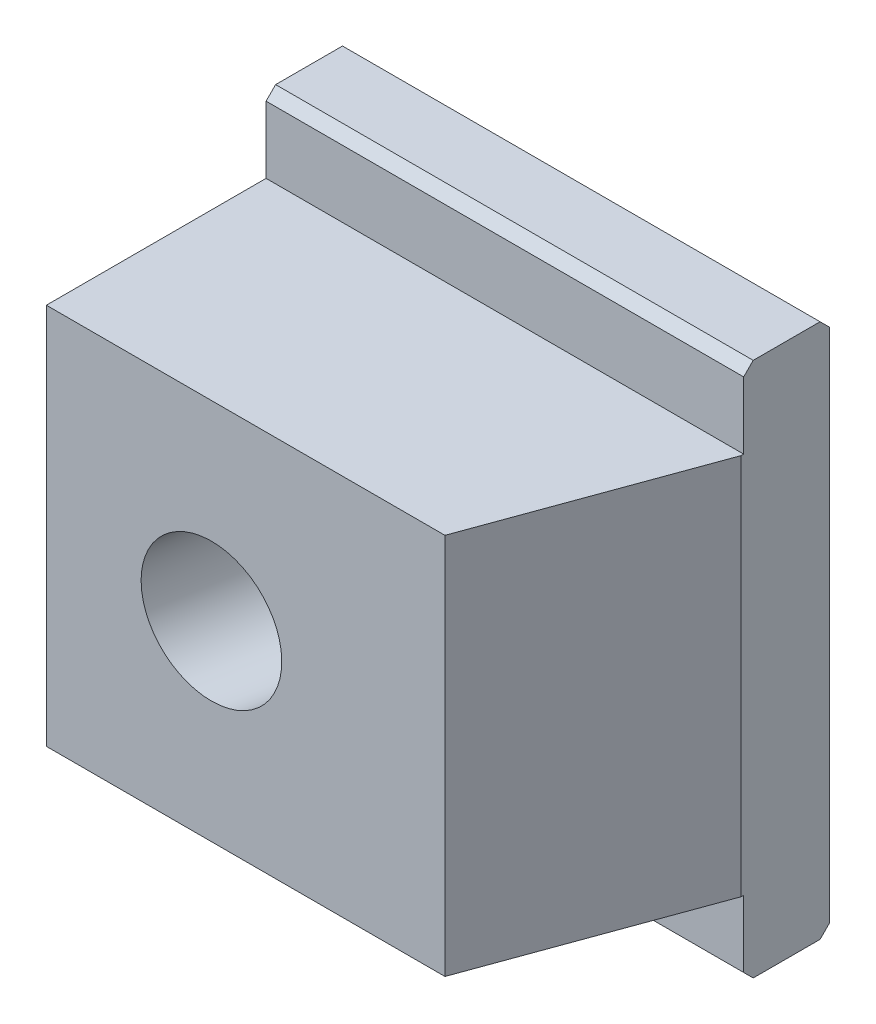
ISO-10303-21;
HEADER;
FILE_DESCRIPTION(('STEP AP214'),'2;1');
FILE_NAME('part.step','',(''),(''),'','','');
FILE_SCHEMA(('AUTOMOTIVE_DESIGN { 1 0 10303 214 1 1 1 1 }'));
ENDSEC;
DATA;
#1=APPLICATION_CONTEXT('core data for automotive mechanical design processes');
#2=APPLICATION_PROTOCOL_DEFINITION('international standard','automotive_design',2000,#1);
#3=PRODUCT_CONTEXT('',#1,'mechanical');
#4=PRODUCT('Part','Part','',(#3));
#5=PRODUCT_RELATED_PRODUCT_CATEGORY('part','',(#4));
#6=PRODUCT_DEFINITION_FORMATION('','',#4);
#7=PRODUCT_DEFINITION_CONTEXT('part definition',#1,'design');
#8=PRODUCT_DEFINITION('design','',#6,#7);
#9=PRODUCT_DEFINITION_SHAPE('','',#8);
#10=(LENGTH_UNIT() NAMED_UNIT(*) SI_UNIT(.MILLI.,.METRE.));
#11=(NAMED_UNIT(*) PLANE_ANGLE_UNIT() SI_UNIT($,.RADIAN.));
#12=(NAMED_UNIT(*) SI_UNIT($,.STERADIAN.) SOLID_ANGLE_UNIT());
#13=UNCERTAINTY_MEASURE_WITH_UNIT(LENGTH_MEASURE(1.E-05),#10,'distance_accuracy_value','');
#14=(GEOMETRIC_REPRESENTATION_CONTEXT(3) GLOBAL_UNCERTAINTY_ASSIGNED_CONTEXT((#13)) GLOBAL_UNIT_ASSIGNED_CONTEXT((#10,
#11,#12)) REPRESENTATION_CONTEXT('',''));
#15=CARTESIAN_POINT('',(0.,0.,0.));
#16=DIRECTION('',(0.,0.,1.));
#17=DIRECTION('',(1.,0.,0.));
#18=AXIS2_PLACEMENT_3D('',#15,#16,#17);
#19=CARTESIAN_POINT('',(121.,-21.85,-40.));
#20=DIRECTION('',(-1.,0.,0.));
#21=DIRECTION('',(0.,0.,-1.));
#22=AXIS2_PLACEMENT_3D('',#19,#20,#21);
#23=PLANE('',#22);
#24=CARTESIAN_POINT('',(121.,-27.85,-10.));
#25=DIRECTION('',(-1.,0.,0.));
#26=DIRECTION('',(0.,0.,1.));
#27=AXIS2_PLACEMENT_3D('',#24,#25,#26);
#28=CIRCLE('',#27,2.1);
#29=CARTESIAN_POINT('',(121.,-27.85,-7.9));
#30=VERTEX_POINT('',#29);
#31=EDGE_CURVE('E338',#30,#30,#28,.T.);
#32=ORIENTED_EDGE('',*,*,#31,.F.);
#33=EDGE_LOOP('',(#32));
#34=FACE_BOUND('',#33,.T.);
#35=CARTESIAN_POINT('',(121.,-55.85,-23.));
#36=DIRECTION('',(-1.,0.,0.));
#37=DIRECTION('',(0.,0.,1.));
#38=AXIS2_PLACEMENT_3D('',#35,#36,#37);
#39=CIRCLE('',#38,2.1);
#40=CARTESIAN_POINT('',(121.,-55.85,-20.9));
#41=VERTEX_POINT('',#40);
#42=EDGE_CURVE('E340',#41,#41,#39,.T.);
#43=ORIENTED_EDGE('',*,*,#42,.F.);
#44=EDGE_LOOP('',(#43));
#45=FACE_BOUND('',#44,.T.);
#46=DIRECTION('',(0.,0.,-1.));
#47=VECTOR('',#46,1.);
#48=CARTESIAN_POINT('',(121.,-13.8500000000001,-25.));
#49=LINE('',#48,#47);
#50=CARTESIAN_POINT('',(121.,-13.8500000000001,-26.));
#51=VERTEX_POINT('',#50);
#52=CARTESIAN_POINT('',(121.,-13.8500000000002,-33.));
#53=VERTEX_POINT('',#52);
#54=EDGE_CURVE('E138',#51,#53,#49,.T.);
#55=ORIENTED_EDGE('',*,*,#54,.T.);
#56=DIRECTION('',(0.,0.707106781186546,0.707106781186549));
#57=VECTOR('',#56,1.);
#58=CARTESIAN_POINT('',(121.,-21.35,-40.5));
#59=LINE('',#58,#57);
#60=CARTESIAN_POINT('',(121.,-14.8500000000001,-34.));
#61=VERTEX_POINT('',#60);
#62=EDGE_CURVE('E37',#53,#61,#59,.F.);
#63=ORIENTED_EDGE('',*,*,#62,.T.);
#64=DIRECTION('',(0.,-1.,0.));
#65=VECTOR('',#64,1.);
#66=CARTESIAN_POINT('',(121.,-21.85,-34.));
#67=LINE('',#66,#65);
#68=CARTESIAN_POINT('',(121.,-68.85,-34.));
#69=VERTEX_POINT('',#68);
#70=EDGE_CURVE('E179',#61,#69,#67,.T.);
#71=ORIENTED_EDGE('',*,*,#70,.T.);
#72=DIRECTION('',(0.,0.707106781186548,-0.707106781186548));
#73=VECTOR('',#72,1.);
#74=CARTESIAN_POINT('',(121.,-42.35,-60.5));
#75=LINE('',#74,#73);
#76=CARTESIAN_POINT('',(121.,-69.85,-33.));
#77=VERTEX_POINT('',#76);
#78=EDGE_CURVE('E142',#69,#77,#75,.F.);
#79=ORIENTED_EDGE('',*,*,#78,.T.);
#80=DIRECTION('',(0.,0.,1.));
#81=VECTOR('',#80,1.);
#82=CARTESIAN_POINT('',(121.,-69.85,-40.));
#83=LINE('',#82,#81);
#84=CARTESIAN_POINT('',(121.,-69.85,-26.));
#85=VERTEX_POINT('',#84);
#86=EDGE_CURVE('E174',#77,#85,#83,.T.);
#87=ORIENTED_EDGE('',*,*,#86,.T.);
#88=DIRECTION('',(0.,-0.707106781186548,-0.707106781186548));
#89=VECTOR('',#88,1.);
#90=CARTESIAN_POINT('',(121.,-52.85,-9.));
#91=LINE('',#90,#89);
#92=CARTESIAN_POINT('',(121.,-68.85,-25.));
#93=VERTEX_POINT('',#92);
#94=EDGE_CURVE('E158',#85,#93,#91,.F.);
#95=ORIENTED_EDGE('',*,*,#94,.T.);
#96=DIRECTION('',(0.,1.,0.));
#97=VECTOR('',#96,1.);
#98=CARTESIAN_POINT('',(121.,-69.85,-25.));
#99=LINE('',#98,#97);
#100=CARTESIAN_POINT('',(121.,-61.85,-25.));
#101=VERTEX_POINT('',#100);
#102=EDGE_CURVE('E171',#93,#101,#99,.T.);
#103=ORIENTED_EDGE('',*,*,#102,.T.);
#104=DIRECTION('',(0.,0.,-1.));
#105=VECTOR('',#104,1.);
#106=CARTESIAN_POINT('',(121.,-61.85,-2.));
#107=LINE('',#106,#105);
#108=CARTESIAN_POINT('',(121.,-61.85,-2.));
#109=VERTEX_POINT('',#108);
#110=EDGE_CURVE('E167',#109,#101,#107,.T.);
#111=ORIENTED_EDGE('',*,*,#110,.F.);
#112=DIRECTION('',(0.,-1.,0.));
#113=VECTOR('',#112,1.);
#114=CARTESIAN_POINT('',(121.,-21.85,-2.));
#115=LINE('',#114,#113);
#116=CARTESIAN_POINT('',(121.,-21.85,-2.));
#117=VERTEX_POINT('',#116);
#118=EDGE_CURVE('E163',#117,#109,#115,.T.);
#119=ORIENTED_EDGE('',*,*,#118,.F.);
#120=DIRECTION('',(0.,0.,1.));
#121=VECTOR('',#120,1.);
#122=CARTESIAN_POINT('',(121.,-21.85,-40.));
#123=LINE('',#122,#121);
#124=CARTESIAN_POINT('',(121.,-21.85,-25.));
#125=VERTEX_POINT('',#124);
#126=EDGE_CURVE('E160',#125,#117,#123,.T.);
#127=ORIENTED_EDGE('',*,*,#126,.F.);
#128=DIRECTION('',(0.,1.,0.));
#129=VECTOR('',#128,1.);
#130=CARTESIAN_POINT('',(121.,-21.85,-25.));
#131=LINE('',#130,#129);
#132=CARTESIAN_POINT('',(121.,-14.8500000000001,-25.));
#133=VERTEX_POINT('',#132);
#134=EDGE_CURVE('E148',#125,#133,#131,.T.);
#135=ORIENTED_EDGE('',*,*,#134,.T.);
#136=DIRECTION('',(0.,-0.707106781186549,0.707106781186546));
#137=VECTOR('',#136,1.);
#138=CARTESIAN_POINT('',(121.,-10.8500000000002,-29.));
#139=LINE('',#138,#137);
#140=EDGE_CURVE('E132',#133,#51,#139,.F.);
#141=ORIENTED_EDGE('',*,*,#140,.T.);
#142=EDGE_LOOP('',(#55,#63,#71,#79,#87,#95,#103,#111,#119,#127,#135,#141));
#143=FACE_BOUND('',#142,.T.);
#144=ADVANCED_FACE('F34',(#34,#45,#143),#23,.T.);
#145=CARTESIAN_POINT('',(171.,-21.85,-40.));
#146=DIRECTION('',(-1.,0.,0.));
#147=DIRECTION('',(0.,0.,-1.));
#148=AXIS2_PLACEMENT_3D('',#145,#146,#147);
#149=PLANE('',#148);
#150=DIRECTION('',(0.,-1.,0.));
#151=VECTOR('',#150,1.);
#152=CARTESIAN_POINT('',(171.,-21.85,-34.));
#153=LINE('',#152,#151);
#154=CARTESIAN_POINT('',(171.,-14.8500000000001,-34.));
#155=VERTEX_POINT('',#154);
#156=CARTESIAN_POINT('',(171.,-68.85,-34.));
#157=VERTEX_POINT('',#156);
#158=EDGE_CURVE('E180',#155,#157,#153,.T.);
#159=ORIENTED_EDGE('',*,*,#158,.F.);
#160=DIRECTION('',(0.,-0.707106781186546,-0.707106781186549));
#161=VECTOR('',#160,1.);
#162=CARTESIAN_POINT('',(171.,-13.8500000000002,-33.));
#163=LINE('',#162,#161);
#164=CARTESIAN_POINT('',(171.,-13.8500000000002,-33.));
#165=VERTEX_POINT('',#164);
#166=EDGE_CURVE('E156',#155,#165,#163,.F.);
#167=ORIENTED_EDGE('',*,*,#166,.T.);
#168=DIRECTION('',(0.,0.,-1.));
#169=VECTOR('',#168,1.);
#170=CARTESIAN_POINT('',(171.,-13.8500000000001,-25.));
#171=LINE('',#170,#169);
#172=CARTESIAN_POINT('',(171.,-13.8500000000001,-26.));
#173=VERTEX_POINT('',#172);
#174=EDGE_CURVE('E141',#173,#165,#171,.T.);
#175=ORIENTED_EDGE('',*,*,#174,.F.);
#176=DIRECTION('',(0.,0.707106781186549,-0.707106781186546));
#177=VECTOR('',#176,1.);
#178=CARTESIAN_POINT('',(171.,-13.8500000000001,-26.));
#179=LINE('',#178,#177);
#180=CARTESIAN_POINT('',(171.,-14.8500000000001,-25.));
#181=VERTEX_POINT('',#180);
#182=EDGE_CURVE('E241',#173,#181,#179,.F.);
#183=ORIENTED_EDGE('',*,*,#182,.T.);
#184=DIRECTION('',(0.,1.,0.));
#185=VECTOR('',#184,1.);
#186=CARTESIAN_POINT('',(171.,-21.85,-25.));
#187=LINE('',#186,#185);
#188=CARTESIAN_POINT('',(171.,-21.85,-25.));
#189=VERTEX_POINT('',#188);
#190=EDGE_CURVE('E178',#189,#181,#187,.T.);
#191=ORIENTED_EDGE('',*,*,#190,.F.);
#192=DIRECTION('',(0.,0.,1.));
#193=VECTOR('',#192,1.);
#194=CARTESIAN_POINT('',(171.,-21.85,-40.));
#195=LINE('',#194,#193);
#196=CARTESIAN_POINT('',(171.,-21.85,-24.7272967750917));
#197=VERTEX_POINT('',#196);
#198=EDGE_CURVE('E170',#189,#197,#195,.T.);
#199=ORIENTED_EDGE('',*,*,#198,.T.);
#200=DIRECTION('',(0.,-1.,0.));
#201=VECTOR('',#200,1.);
#202=CARTESIAN_POINT('',(171.,-9.04997250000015,-24.7272967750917));
#203=LINE('',#202,#201);
#204=CARTESIAN_POINT('',(171.,-61.85,-24.7272967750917));
#205=VERTEX_POINT('',#204);
#206=EDGE_CURVE('E212',#197,#205,#203,.T.);
#207=ORIENTED_EDGE('',*,*,#206,.T.);
#208=DIRECTION('',(0.,0.,-1.));
#209=VECTOR('',#208,1.);
#210=CARTESIAN_POINT('',(171.,-61.85,-2.));
#211=LINE('',#210,#209);
#212=CARTESIAN_POINT('',(171.,-61.85,-25.));
#213=VERTEX_POINT('',#212);
#214=EDGE_CURVE('E225',#205,#213,#211,.T.);
#215=ORIENTED_EDGE('',*,*,#214,.T.);
#216=DIRECTION('',(0.,1.,0.));
#217=VECTOR('',#216,1.);
#218=CARTESIAN_POINT('',(171.,-69.85,-25.));
#219=LINE('',#218,#217);
#220=CARTESIAN_POINT('',(171.,-68.85,-25.));
#221=VERTEX_POINT('',#220);
#222=EDGE_CURVE('E222',#221,#213,#219,.T.);
#223=ORIENTED_EDGE('',*,*,#222,.F.);
#224=DIRECTION('',(0.,0.707106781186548,0.707106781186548));
#225=VECTOR('',#224,1.);
#226=CARTESIAN_POINT('',(171.,-68.85,-25.));
#227=LINE('',#226,#225);
#228=CARTESIAN_POINT('',(171.,-69.85,-26.));
#229=VERTEX_POINT('',#228);
#230=EDGE_CURVE('E52',#221,#229,#227,.F.);
#231=ORIENTED_EDGE('',*,*,#230,.T.);
#232=DIRECTION('',(0.,0.,1.));
#233=VECTOR('',#232,1.);
#234=CARTESIAN_POINT('',(171.,-69.85,-40.));
#235=LINE('',#234,#233);
#236=CARTESIAN_POINT('',(171.,-69.85,-33.));
#237=VERTEX_POINT('',#236);
#238=EDGE_CURVE('E164',#237,#229,#235,.T.);
#239=ORIENTED_EDGE('',*,*,#238,.F.);
#240=DIRECTION('',(0.,-0.707106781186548,0.707106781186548));
#241=VECTOR('',#240,1.);
#242=CARTESIAN_POINT('',(171.,-69.85,-33.));
#243=LINE('',#242,#241);
#244=EDGE_CURVE('E201',#237,#157,#243,.F.);
#245=ORIENTED_EDGE('',*,*,#244,.T.);
#246=EDGE_LOOP('',(#159,#167,#175,#183,#191,#199,#207,#215,#223,#231,#239,#245));
#247=FACE_BOUND('',#246,.T.);
#248=ADVANCED_FACE('F252',(#247),#149,.F.);
#249=CARTESIAN_POINT('',(-325.,-69.85,-40.));
#250=DIRECTION('',(0.,-1.,0.));
#251=DIRECTION('',(0.,0.,-1.));
#252=AXIS2_PLACEMENT_3D('',#249,#250,#251);
#253=PLANE('',#252);
#254=ORIENTED_EDGE('',*,*,#238,.T.);
#255=DIRECTION('',(-1.,0.,0.));
#256=VECTOR('',#255,1.);
#257=CARTESIAN_POINT('',(-325.,-69.85,-26.));
#258=LINE('',#257,#256);
#259=EDGE_CURVE('E11',#229,#85,#258,.T.);
#260=ORIENTED_EDGE('',*,*,#259,.T.);
#261=ORIENTED_EDGE('',*,*,#86,.F.);
#262=DIRECTION('',(1.,0.,0.));
#263=VECTOR('',#262,1.);
#264=CARTESIAN_POINT('',(-325.,-69.85,-33.));
#265=LINE('',#264,#263);
#266=EDGE_CURVE('E43',#77,#237,#265,.T.);
#267=ORIENTED_EDGE('',*,*,#266,.T.);
#268=EDGE_LOOP('',(#254,#260,#261,#267));
#269=FACE_BOUND('',#268,.T.);
#270=ADVANCED_FACE('F254',(#269),#253,.T.);
#271=CARTESIAN_POINT('',(-325.,-13.8500000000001,-25.));
#272=DIRECTION('',(0.,1.,0.));
#273=DIRECTION('',(0.,0.,1.));
#274=AXIS2_PLACEMENT_3D('',#271,#272,#273);
#275=PLANE('',#274);
#276=ORIENTED_EDGE('',*,*,#174,.T.);
#277=DIRECTION('',(-1.,0.,0.));
#278=VECTOR('',#277,1.);
#279=CARTESIAN_POINT('',(-325.,-13.8500000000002,-33.));
#280=LINE('',#279,#278);
#281=EDGE_CURVE('E129',#165,#53,#280,.T.);
#282=ORIENTED_EDGE('',*,*,#281,.T.);
#283=ORIENTED_EDGE('',*,*,#54,.F.);
#284=DIRECTION('',(1.,0.,0.));
#285=VECTOR('',#284,1.);
#286=CARTESIAN_POINT('',(-325.,-13.8500000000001,-26.));
#287=LINE('',#286,#285);
#288=EDGE_CURVE('E143',#51,#173,#287,.T.);
#289=ORIENTED_EDGE('',*,*,#288,.T.);
#290=EDGE_LOOP('',(#276,#282,#283,#289));
#291=FACE_BOUND('',#290,.T.);
#292=ADVANCED_FACE('F136',(#291),#275,.T.);
#293=CARTESIAN_POINT('',(146.716830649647,-41.85,-49.8434097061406));
#294=DIRECTION('',(-0.17364817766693,0.,0.984807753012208));
#295=DIRECTION('',(0.984807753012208,0.,0.17364817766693));
#296=AXIS2_PLACEMENT_3D('',#293,#294,#295);
#297=CYLINDRICAL_SURFACE('',#296,7.25);
#298=CARTESIAN_POINT('',(138.280746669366,-41.85,-2.));
#299=DIRECTION('',(0.,0.,1.));
#300=DIRECTION('',(-1.,0.,0.));
#301=AXIS2_PLACEMENT_3D('',#298,#299,#300);
#302=ELLIPSE('',#301,7.36184293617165,7.25);
#303=CARTESIAN_POINT('',(130.918903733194,-41.85,-2.));
#304=VERTEX_POINT('',#303);
#305=EDGE_CURVE('E184',#304,#304,#302,.T.);
#306=ORIENTED_EDGE('',*,*,#305,.T.);
#307=EDGE_LOOP('',(#306));
#308=FACE_BOUND('',#307,.T.);
#309=CARTESIAN_POINT('',(143.923210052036,-41.85,-34.));
#310=DIRECTION('',(0.,0.,-1.));
#311=DIRECTION('',(-1.,0.,0.));
#312=AXIS2_PLACEMENT_3D('',#309,#310,#311);
#313=ELLIPSE('',#312,7.36184293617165,7.25);
#314=CARTESIAN_POINT('',(136.561367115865,-41.85,-34.));
#315=VERTEX_POINT('',#314);
#316=EDGE_CURVE('E181',#315,#315,#313,.F.);
#317=ORIENTED_EDGE('',*,*,#316,.F.);
#318=EDGE_LOOP('',(#317));
#319=FACE_BOUND('',#318,.T.);
#320=ADVANCED_FACE('F282',(#308,#319),#297,.F.);
#321=CARTESIAN_POINT('',(170.,-21.85,-40.));
#322=DIRECTION('',(0.,1.,0.));
#323=DIRECTION('',(0.,0.,1.));
#324=AXIS2_PLACEMENT_3D('',#321,#322,#323);
#325=PLANE('',#324);
#326=ORIENTED_EDGE('',*,*,#198,.F.);
#327=DIRECTION('',(1.,0.,0.));
#328=VECTOR('',#327,1.);
#329=CARTESIAN_POINT('',(-325.,-21.85,-25.));
#330=LINE('',#329,#328);
#331=EDGE_CURVE('E147',#125,#189,#330,.T.);
#332=ORIENTED_EDGE('',*,*,#331,.F.);
#333=ORIENTED_EDGE('',*,*,#126,.T.);
#334=DIRECTION('',(-1.,0.,0.));
#335=VECTOR('',#334,1.);
#336=CARTESIAN_POINT('',(170.,-21.85,-2.));
#337=LINE('',#336,#335);
#338=CARTESIAN_POINT('',(162.727940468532,-21.85,-2.));
#339=VERTEX_POINT('',#338);
#340=EDGE_CURVE('E196',#339,#117,#337,.T.);
#341=ORIENTED_EDGE('',*,*,#340,.F.);
#342=DIRECTION('',(-0.342020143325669,0.,0.939692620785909));
#343=VECTOR('',#342,1.);
#344=CARTESIAN_POINT('',(175.791574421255,-21.85,-37.8920393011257));
#345=LINE('',#344,#343);
#346=EDGE_CURVE('E152',#197,#339,#345,.T.);
#347=ORIENTED_EDGE('',*,*,#346,.F.);
#348=EDGE_LOOP('',(#326,#332,#333,#341,#347));
#349=FACE_BOUND('',#348,.T.);
#350=ADVANCED_FACE('F278',(#349),#325,.T.);
#351=CARTESIAN_POINT('',(170.,-21.85,-2.));
#352=DIRECTION('',(0.,0.,1.));
#353=DIRECTION('',(-1.,0.,0.));
#354=AXIS2_PLACEMENT_3D('',#351,#352,#353);
#355=PLANE('',#354);
#356=DIRECTION('',(-1.,0.,0.));
#357=VECTOR('',#356,1.);
#358=CARTESIAN_POINT('',(170.,-61.85,-2.));
#359=LINE('',#358,#357);
#360=CARTESIAN_POINT('',(162.727940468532,-61.85,-2.));
#361=VERTEX_POINT('',#360);
#362=EDGE_CURVE('E223',#361,#109,#359,.T.);
#363=ORIENTED_EDGE('',*,*,#362,.F.);
#364=DIRECTION('',(0.,-1.,0.));
#365=VECTOR('',#364,1.);
#366=CARTESIAN_POINT('',(162.727940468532,-21.85,-2.));
#367=LINE('',#366,#365);
#368=EDGE_CURVE('E209',#339,#361,#367,.T.);
#369=ORIENTED_EDGE('',*,*,#368,.F.);
#370=ORIENTED_EDGE('',*,*,#340,.T.);
#371=ORIENTED_EDGE('',*,*,#118,.T.);
#372=EDGE_LOOP('',(#363,#369,#370,#371));
#373=FACE_BOUND('',#372,.T.);
#374=ORIENTED_EDGE('',*,*,#305,.F.);
#375=EDGE_LOOP('',(#374));
#376=FACE_BOUND('',#375,.T.);
#377=ADVANCED_FACE('F281',(#373,#376),#355,.T.);
#378=CARTESIAN_POINT('',(170.,-61.85,-2.));
#379=DIRECTION('',(0.,-1.,0.));
#380=DIRECTION('',(0.,0.,-1.));
#381=AXIS2_PLACEMENT_3D('',#378,#379,#380);
#382=PLANE('',#381);
#383=ORIENTED_EDGE('',*,*,#362,.T.);
#384=ORIENTED_EDGE('',*,*,#110,.T.);
#385=DIRECTION('',(1.,0.,0.));
#386=VECTOR('',#385,1.);
#387=CARTESIAN_POINT('',(-325.,-61.85,-25.));
#388=LINE('',#387,#386);
#389=EDGE_CURVE('E173',#101,#213,#388,.T.);
#390=ORIENTED_EDGE('',*,*,#389,.T.);
#391=ORIENTED_EDGE('',*,*,#214,.F.);
#392=DIRECTION('',(0.342020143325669,0.,-0.939692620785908));
#393=VECTOR('',#392,1.);
#394=CARTESIAN_POINT('',(162.,-61.85,0.));
#395=LINE('',#394,#393);
#396=EDGE_CURVE('E217',#361,#205,#395,.T.);
#397=ORIENTED_EDGE('',*,*,#396,.F.);
#398=EDGE_LOOP('',(#383,#384,#390,#391,#397));
#399=FACE_BOUND('',#398,.T.);
#400=ADVANCED_FACE('F286',(#399),#382,.T.);
#401=CARTESIAN_POINT('',(-325.,-69.85,-25.));
#402=DIRECTION('',(0.,0.,1.));
#403=DIRECTION('',(-1.,0.,0.));
#404=AXIS2_PLACEMENT_3D('',#401,#402,#403);
#405=PLANE('',#404);
#406=ORIENTED_EDGE('',*,*,#102,.F.);
#407=DIRECTION('',(1.,0.,0.));
#408=VECTOR('',#407,1.);
#409=CARTESIAN_POINT('',(-325.,-68.85,-25.));
#410=LINE('',#409,#408);
#411=EDGE_CURVE('E204',#93,#221,#410,.T.);
#412=ORIENTED_EDGE('',*,*,#411,.T.);
#413=ORIENTED_EDGE('',*,*,#222,.T.);
#414=ORIENTED_EDGE('',*,*,#389,.F.);
#415=EDGE_LOOP('',(#406,#412,#413,#414));
#416=FACE_BOUND('',#415,.T.);
#417=ADVANCED_FACE('F249',(#416),#405,.T.);
#418=CARTESIAN_POINT('',(-325.,-21.85,-25.));
#419=DIRECTION('',(0.,0.,1.));
#420=DIRECTION('',(-1.,0.,0.));
#421=AXIS2_PLACEMENT_3D('',#418,#419,#420);
#422=PLANE('',#421);
#423=ORIENTED_EDGE('',*,*,#190,.T.);
#424=DIRECTION('',(-1.,0.,0.));
#425=VECTOR('',#424,1.);
#426=CARTESIAN_POINT('',(-325.,-14.8500000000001,-25.));
#427=LINE('',#426,#425);
#428=EDGE_CURVE('E202',#181,#133,#427,.T.);
#429=ORIENTED_EDGE('',*,*,#428,.T.);
#430=ORIENTED_EDGE('',*,*,#134,.F.);
#431=ORIENTED_EDGE('',*,*,#331,.T.);
#432=EDGE_LOOP('',(#423,#429,#430,#431));
#433=FACE_BOUND('',#432,.T.);
#434=ADVANCED_FACE('F291',(#433),#422,.T.);
#435=CARTESIAN_POINT('',(162.,-9.04997250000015,0.));
#436=DIRECTION('',(0.939692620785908,0.,0.342020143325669));
#437=DIRECTION('',(-0.342020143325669,0.,0.939692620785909));
#438=AXIS2_PLACEMENT_3D('',#435,#436,#437);
#439=PLANE('',#438);
#440=ORIENTED_EDGE('',*,*,#368,.T.);
#441=ORIENTED_EDGE('',*,*,#396,.T.);
#442=ORIENTED_EDGE('',*,*,#206,.F.);
#443=ORIENTED_EDGE('',*,*,#346,.T.);
#444=EDGE_LOOP('',(#440,#441,#442,#443));
#445=FACE_BOUND('',#444,.T.);
#446=ADVANCED_FACE('F297',(#445),#439,.T.);
#447=CARTESIAN_POINT('',(237.6,-1.85000000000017,-34.));
#448=DIRECTION('',(0.,0.,-1.));
#449=DIRECTION('',(0.,1.,0.));
#450=AXIS2_PLACEMENT_3D('',#447,#448,#449);
#451=PLANE('',#450);
#452=CARTESIAN_POINT('',(162.,-41.85,-34.));
#453=DIRECTION('',(0.,0.,1.));
#454=DIRECTION('',(0.,-1.,0.));
#455=AXIS2_PLACEMENT_3D('',#452,#453,#454);
#456=CIRCLE('',#455,4.);
#457=CARTESIAN_POINT('',(162.,-45.85,-34.));
#458=VERTEX_POINT('',#457);
#459=EDGE_CURVE('E192',#458,#458,#456,.T.);
#460=ORIENTED_EDGE('',*,*,#459,.T.);
#461=EDGE_LOOP('',(#460));
#462=FACE_BOUND('',#461,.T.);
#463=ORIENTED_EDGE('',*,*,#316,.T.);
#464=EDGE_LOOP('',(#463));
#465=FACE_BOUND('',#464,.T.);
#466=ORIENTED_EDGE('',*,*,#70,.F.);
#467=DIRECTION('',(1.,0.,0.));
#468=VECTOR('',#467,1.);
#469=CARTESIAN_POINT('',(237.6,-14.8500000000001,-34.));
#470=LINE('',#469,#468);
#471=EDGE_CURVE('E130',#61,#155,#470,.T.);
#472=ORIENTED_EDGE('',*,*,#471,.T.);
#473=ORIENTED_EDGE('',*,*,#158,.T.);
#474=DIRECTION('',(-1.,0.,0.));
#475=VECTOR('',#474,1.);
#476=CARTESIAN_POINT('',(237.6,-68.85,-34.));
#477=LINE('',#476,#475);
#478=EDGE_CURVE('E131',#157,#69,#477,.T.);
#479=ORIENTED_EDGE('',*,*,#478,.T.);
#480=EDGE_LOOP('',(#466,#472,#473,#479));
#481=FACE_BOUND('',#480,.T.);
#482=ADVANCED_FACE('F277',(#462,#465,#481),#451,.T.);
#483=CARTESIAN_POINT('',(-325.,-13.8500000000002,-33.));
#484=DIRECTION('',(0.,-0.707106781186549,0.707106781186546));
#485=DIRECTION('',(0.,-0.707106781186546,-0.707106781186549));
#486=AXIS2_PLACEMENT_3D('',#483,#484,#485);
#487=PLANE('',#486);
#488=ORIENTED_EDGE('',*,*,#166,.F.);
#489=ORIENTED_EDGE('',*,*,#471,.F.);
#490=ORIENTED_EDGE('',*,*,#62,.F.);
#491=ORIENTED_EDGE('',*,*,#281,.F.);
#492=EDGE_LOOP('',(#488,#489,#490,#491));
#493=FACE_BOUND('',#492,.T.);
#494=ADVANCED_FACE('F128',(#493),#487,.F.);
#495=CARTESIAN_POINT('',(-325.,-13.8500000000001,-26.));
#496=DIRECTION('',(0.,-0.707106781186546,-0.707106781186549));
#497=DIRECTION('',(0.,0.707106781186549,-0.707106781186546));
#498=AXIS2_PLACEMENT_3D('',#495,#496,#497);
#499=PLANE('',#498);
#500=ORIENTED_EDGE('',*,*,#140,.F.);
#501=ORIENTED_EDGE('',*,*,#428,.F.);
#502=ORIENTED_EDGE('',*,*,#182,.F.);
#503=ORIENTED_EDGE('',*,*,#288,.F.);
#504=EDGE_LOOP('',(#500,#501,#502,#503));
#505=FACE_BOUND('',#504,.T.);
#506=ADVANCED_FACE('F270',(#505),#499,.F.);
#507=CARTESIAN_POINT('',(-325.,-68.85,-25.));
#508=DIRECTION('',(0.,0.707106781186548,-0.707106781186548));
#509=DIRECTION('',(0.,0.707106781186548,0.707106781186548));
#510=AXIS2_PLACEMENT_3D('',#507,#508,#509);
#511=PLANE('',#510);
#512=ORIENTED_EDGE('',*,*,#94,.F.);
#513=ORIENTED_EDGE('',*,*,#259,.F.);
#514=ORIENTED_EDGE('',*,*,#230,.F.);
#515=ORIENTED_EDGE('',*,*,#411,.F.);
#516=EDGE_LOOP('',(#512,#513,#514,#515));
#517=FACE_BOUND('',#516,.T.);
#518=ADVANCED_FACE('F266',(#517),#511,.F.);
#519=CARTESIAN_POINT('',(-325.,-69.85,-33.));
#520=DIRECTION('',(0.,0.707106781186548,0.707106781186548));
#521=DIRECTION('',(0.,-0.707106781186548,0.707106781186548));
#522=AXIS2_PLACEMENT_3D('',#519,#520,#521);
#523=PLANE('',#522);
#524=ORIENTED_EDGE('',*,*,#78,.F.);
#525=ORIENTED_EDGE('',*,*,#478,.F.);
#526=ORIENTED_EDGE('',*,*,#244,.F.);
#527=ORIENTED_EDGE('',*,*,#266,.F.);
#528=EDGE_LOOP('',(#524,#525,#526,#527));
#529=FACE_BOUND('',#528,.T.);
#530=ADVANCED_FACE('F262',(#529),#523,.F.);
#531=CARTESIAN_POINT('',(162.,-41.85,-33.));
#532=DIRECTION('',(0.,0.,-1.));
#533=DIRECTION('',(0.,1.,0.));
#534=AXIS2_PLACEMENT_3D('',#531,#532,#533);
#535=CONICAL_SURFACE('',#534,4.,1.02974425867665);
#536=CARTESIAN_POINT('',(162.,-41.85,-33.));
#537=DIRECTION('',(0.,0.,1.));
#538=DIRECTION('',(0.,-1.,0.));
#539=AXIS2_PLACEMENT_3D('',#536,#537,#538);
#540=CIRCLE('',#539,4.);
#541=CARTESIAN_POINT('',(162.,-45.85,-33.));
#542=VERTEX_POINT('',#541);
#543=EDGE_CURVE('E187',#542,#542,#540,.T.);
#544=ORIENTED_EDGE('',*,*,#543,.F.);
#545=EDGE_LOOP('',(#544));
#546=FACE_BOUND('',#545,.T.);
#547=CARTESIAN_POINT('',(162.,-41.85,-30.5965575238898));
#548=VERTEX_POINT('',#547);
#549=VERTEX_LOOP('',#548);
#550=FACE_BOUND('',#549,.T.);
#551=ADVANCED_FACE('F265',(#546,#550),#535,.F.);
#552=CARTESIAN_POINT('',(162.,-41.85,-34.));
#553=DIRECTION('',(0.,0.,1.));
#554=DIRECTION('',(0.,-1.,0.));
#555=AXIS2_PLACEMENT_3D('',#552,#553,#554);
#556=CYLINDRICAL_SURFACE('',#555,4.);
#557=ORIENTED_EDGE('',*,*,#543,.T.);
#558=EDGE_LOOP('',(#557));
#559=FACE_BOUND('',#558,.T.);
#560=ORIENTED_EDGE('',*,*,#459,.F.);
#561=EDGE_LOOP('',(#560));
#562=FACE_BOUND('',#561,.T.);
#563=ADVANCED_FACE('F308',(#559,#562),#556,.F.);
#564=CARTESIAN_POINT('',(132.,-55.85,-23.));
#565=DIRECTION('',(-1.,0.,0.));
#566=DIRECTION('',(0.,0.,1.));
#567=AXIS2_PLACEMENT_3D('',#564,#565,#566);
#568=CONICAL_SURFACE('',#567,2.1,1.02974425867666);
#569=CARTESIAN_POINT('',(133.261807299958,-55.85,-23.));
#570=VERTEX_POINT('',#569);
#571=VERTEX_LOOP('',#570);
#572=FACE_BOUND('',#571,.T.);
#573=CARTESIAN_POINT('',(132.,-55.85,-23.));
#574=DIRECTION('',(-1.,0.,0.));
#575=DIRECTION('',(0.,0.,1.));
#576=AXIS2_PLACEMENT_3D('',#573,#574,#575);
#577=CIRCLE('',#576,2.1);
#578=CARTESIAN_POINT('',(132.,-55.85,-20.9));
#579=VERTEX_POINT('',#578);
#580=EDGE_CURVE('E345',#579,#579,#577,.T.);
#581=ORIENTED_EDGE('',*,*,#580,.T.);
#582=EDGE_LOOP('',(#581));
#583=FACE_BOUND('',#582,.T.);
#584=ADVANCED_FACE('F311',(#572,#583),#568,.F.);
#585=CARTESIAN_POINT('',(121.,-55.85,-23.));
#586=DIRECTION('',(-1.,0.,0.));
#587=DIRECTION('',(0.,0.,1.));
#588=AXIS2_PLACEMENT_3D('',#585,#586,#587);
#589=CYLINDRICAL_SURFACE('',#588,2.1);
#590=ORIENTED_EDGE('',*,*,#580,.F.);
#591=EDGE_LOOP('',(#590));
#592=FACE_BOUND('',#591,.T.);
#593=ORIENTED_EDGE('',*,*,#42,.T.);
#594=EDGE_LOOP('',(#593));
#595=FACE_BOUND('',#594,.T.);
#596=ADVANCED_FACE('F318',(#592,#595),#589,.F.);
#597=CARTESIAN_POINT('',(132.,-27.85,-10.));
#598=DIRECTION('',(-1.,0.,0.));
#599=DIRECTION('',(0.,0.,1.));
#600=AXIS2_PLACEMENT_3D('',#597,#598,#599);
#601=CONICAL_SURFACE('',#600,2.1,1.02974425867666);
#602=CARTESIAN_POINT('',(133.261807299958,-27.85,-10.));
#603=VERTEX_POINT('',#602);
#604=VERTEX_LOOP('',#603);
#605=FACE_BOUND('',#604,.T.);
#606=CARTESIAN_POINT('',(132.,-27.85,-10.));
#607=DIRECTION('',(-1.,0.,0.));
#608=DIRECTION('',(0.,0.,1.));
#609=AXIS2_PLACEMENT_3D('',#606,#607,#608);
#610=CIRCLE('',#609,2.1);
#611=CARTESIAN_POINT('',(132.,-27.85,-7.9));
#612=VERTEX_POINT('',#611);
#613=EDGE_CURVE('E335',#612,#612,#610,.T.);
#614=ORIENTED_EDGE('',*,*,#613,.T.);
#615=EDGE_LOOP('',(#614));
#616=FACE_BOUND('',#615,.T.);
#617=ADVANCED_FACE('F322',(#605,#616),#601,.F.);
#618=CARTESIAN_POINT('',(121.,-27.85,-10.));
#619=DIRECTION('',(-1.,0.,0.));
#620=DIRECTION('',(0.,0.,1.));
#621=AXIS2_PLACEMENT_3D('',#618,#619,#620);
#622=CYLINDRICAL_SURFACE('',#621,2.1);
#623=ORIENTED_EDGE('',*,*,#613,.F.);
#624=EDGE_LOOP('',(#623));
#625=FACE_BOUND('',#624,.T.);
#626=ORIENTED_EDGE('',*,*,#31,.T.);
#627=EDGE_LOOP('',(#626));
#628=FACE_BOUND('',#627,.T.);
#629=ADVANCED_FACE('F326',(#625,#628),#622,.F.);
#630=CLOSED_SHELL('',(#144,#248,#270,#292,#320,#350,#377,#400,#417,#434,#446,#482,#494,#506,
#518,#530,#551,#563,#584,#596,#617,#629));
#631=MANIFOLD_SOLID_BREP('B2',#630);
#632=ADVANCED_BREP_SHAPE_REPRESENTATION('',(#18,#631),#14);
#633=SHAPE_DEFINITION_REPRESENTATION(#9,#632);
ENDSEC;
END-ISO-10303-21;
